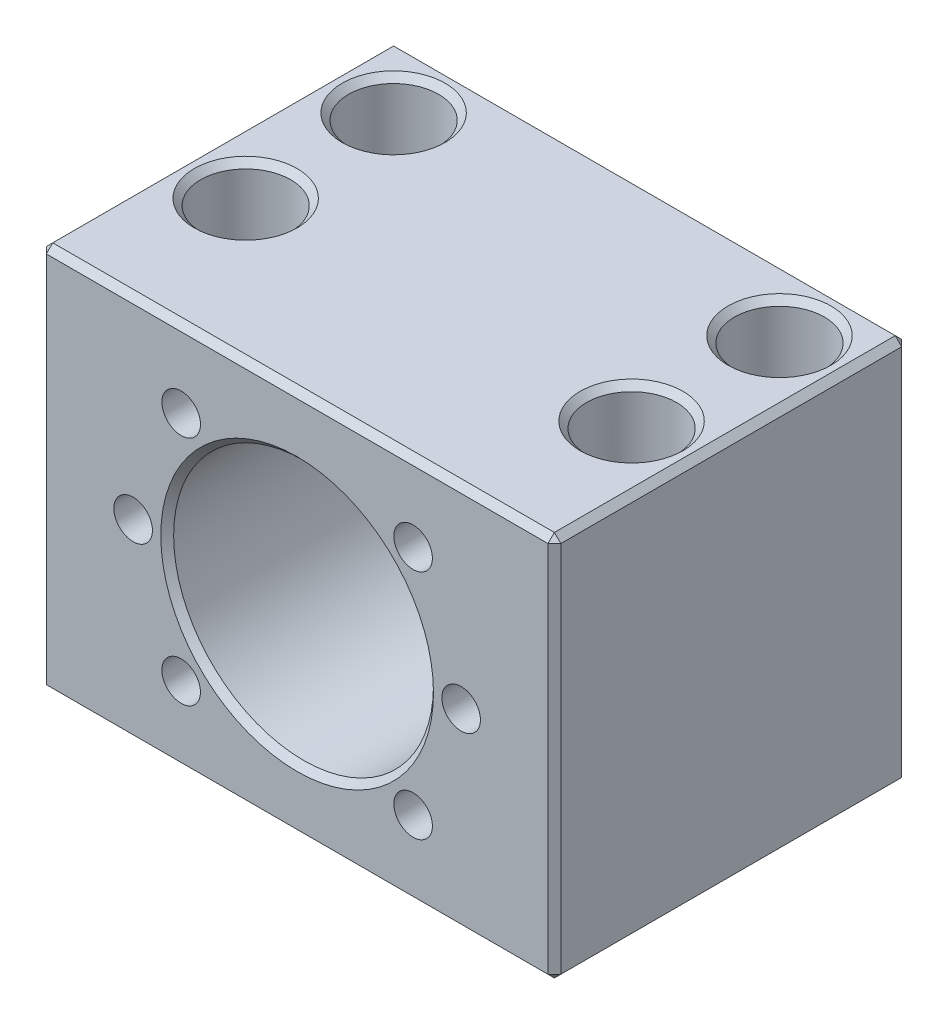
ISO-10303-21;
HEADER;
FILE_DESCRIPTION(('STEP AP214'),'2;1');
FILE_NAME('part.step','',(''),(''),'','','');
FILE_SCHEMA(('AUTOMOTIVE_DESIGN { 1 0 10303 214 1 1 1 1 }'));
ENDSEC;
DATA;
#1=APPLICATION_CONTEXT('core data for automotive mechanical design processes');
#2=APPLICATION_PROTOCOL_DEFINITION('international standard','automotive_design',2000,#1);
#3=PRODUCT_CONTEXT('',#1,'mechanical');
#4=PRODUCT('Part','Part','',(#3));
#5=PRODUCT_RELATED_PRODUCT_CATEGORY('part','',(#4));
#6=PRODUCT_DEFINITION_FORMATION('','',#4);
#7=PRODUCT_DEFINITION_CONTEXT('part definition',#1,'design');
#8=PRODUCT_DEFINITION('design','',#6,#7);
#9=PRODUCT_DEFINITION_SHAPE('','',#8);
#10=(LENGTH_UNIT() NAMED_UNIT(*) SI_UNIT(.MILLI.,.METRE.));
#11=(NAMED_UNIT(*) PLANE_ANGLE_UNIT() SI_UNIT($,.RADIAN.));
#12=(NAMED_UNIT(*) SI_UNIT($,.STERADIAN.) SOLID_ANGLE_UNIT());
#13=UNCERTAINTY_MEASURE_WITH_UNIT(LENGTH_MEASURE(1.E-05),#10,'distance_accuracy_value','');
#14=(GEOMETRIC_REPRESENTATION_CONTEXT(3) GLOBAL_UNCERTAINTY_ASSIGNED_CONTEXT((#13)) GLOBAL_UNIT_ASSIGNED_CONTEXT((#10,
#11,#12)) REPRESENTATION_CONTEXT('',''));
#15=CARTESIAN_POINT('',(0.,0.,0.));
#16=DIRECTION('',(0.,0.,1.));
#17=DIRECTION('',(1.,0.,0.));
#18=AXIS2_PLACEMENT_3D('',#15,#16,#17);
#19=CARTESIAN_POINT('',(30.,19.,-45.));
#20=DIRECTION('',(0.,1.,0.));
#21=DIRECTION('',(0.,0.,1.));
#22=AXIS2_PLACEMENT_3D('',#19,#20,#21);
#23=PLANE('',#22);
#24=CARTESIAN_POINT('',(30.,19.,-45.));
#25=DIRECTION('',(0.,-1.,0.));
#26=DIRECTION('',(0.,0.,-1.));
#27=AXIS2_PLACEMENT_3D('',#24,#25,#26);
#28=CIRCLE('',#27,4.2);
#29=CARTESIAN_POINT('',(30.,19.,-49.2));
#30=VERTEX_POINT('',#29);
#31=EDGE_CURVE('E356',#30,#30,#28,.T.);
#32=ORIENTED_EDGE('',*,*,#31,.T.);
#33=EDGE_LOOP('',(#32));
#34=FACE_BOUND('',#33,.T.);
#35=CARTESIAN_POINT('',(30.,19.,-45.));
#36=DIRECTION('',(0.,-1.,0.));
#37=DIRECTION('',(0.,0.,-1.));
#38=AXIS2_PLACEMENT_3D('',#35,#36,#37);
#39=CIRCLE('',#38,7.);
#40=CARTESIAN_POINT('',(30.,19.,-52.));
#41=VERTEX_POINT('',#40);
#42=EDGE_CURVE('E345',#41,#41,#39,.F.);
#43=ORIENTED_EDGE('',*,*,#42,.T.);
#44=EDGE_LOOP('',(#43));
#45=FACE_BOUND('',#44,.T.);
#46=ADVANCED_FACE('F15',(#34,#45),#23,.T.);
#47=CARTESIAN_POINT('',(-30.,19.,-45.));
#48=DIRECTION('',(0.,1.,0.));
#49=DIRECTION('',(0.,0.,1.));
#50=AXIS2_PLACEMENT_3D('',#47,#48,#49);
#51=PLANE('',#50);
#52=CARTESIAN_POINT('',(-30.,19.,-45.));
#53=DIRECTION('',(0.,-1.,0.));
#54=DIRECTION('',(0.,0.,-1.));
#55=AXIS2_PLACEMENT_3D('',#52,#53,#54);
#56=CIRCLE('',#55,4.2);
#57=CARTESIAN_POINT('',(-30.,19.,-49.2));
#58=VERTEX_POINT('',#57);
#59=EDGE_CURVE('E349',#58,#58,#56,.T.);
#60=ORIENTED_EDGE('',*,*,#59,.T.);
#61=EDGE_LOOP('',(#60));
#62=FACE_BOUND('',#61,.T.);
#63=CARTESIAN_POINT('',(-30.,19.,-45.));
#64=DIRECTION('',(0.,-1.,0.));
#65=DIRECTION('',(0.,0.,-1.));
#66=AXIS2_PLACEMENT_3D('',#63,#64,#65);
#67=CIRCLE('',#66,7.);
#68=CARTESIAN_POINT('',(-30.,19.,-52.));
#69=VERTEX_POINT('',#68);
#70=EDGE_CURVE('E341',#69,#69,#67,.F.);
#71=ORIENTED_EDGE('',*,*,#70,.T.);
#72=EDGE_LOOP('',(#71));
#73=FACE_BOUND('',#72,.T.);
#74=ADVANCED_FACE('F1276',(#62,#73),#51,.T.);
#75=CARTESIAN_POINT('',(-30.,19.,-22.));
#76=DIRECTION('',(0.,1.,0.));
#77=DIRECTION('',(0.,0.,1.));
#78=AXIS2_PLACEMENT_3D('',#75,#76,#77);
#79=PLANE('',#78);
#80=CARTESIAN_POINT('',(-30.,19.,-22.));
#81=DIRECTION('',(0.,-1.,0.));
#82=DIRECTION('',(0.,0.,-1.));
#83=AXIS2_PLACEMENT_3D('',#80,#81,#82);
#84=CIRCLE('',#83,4.2);
#85=CARTESIAN_POINT('',(-30.,19.,-26.2));
#86=VERTEX_POINT('',#85);
#87=EDGE_CURVE('E18',#86,#86,#84,.T.);
#88=ORIENTED_EDGE('',*,*,#87,.T.);
#89=EDGE_LOOP('',(#88));
#90=FACE_BOUND('',#89,.T.);
#91=CARTESIAN_POINT('',(-30.,19.,-22.));
#92=DIRECTION('',(0.,-1.,0.));
#93=DIRECTION('',(0.,0.,-1.));
#94=AXIS2_PLACEMENT_3D('',#91,#92,#93);
#95=CIRCLE('',#94,7.);
#96=CARTESIAN_POINT('',(-30.,19.,-29.));
#97=VERTEX_POINT('',#96);
#98=EDGE_CURVE('E337',#97,#97,#95,.F.);
#99=ORIENTED_EDGE('',*,*,#98,.T.);
#100=EDGE_LOOP('',(#99));
#101=FACE_BOUND('',#100,.T.);
#102=ADVANCED_FACE('F365',(#90,#101),#79,.T.);
#103=CARTESIAN_POINT('',(30.,19.,-22.));
#104=DIRECTION('',(0.,1.,0.));
#105=DIRECTION('',(0.,0.,1.));
#106=AXIS2_PLACEMENT_3D('',#103,#104,#105);
#107=PLANE('',#106);
#108=CARTESIAN_POINT('',(30.,19.,-22.));
#109=DIRECTION('',(0.,-1.,0.));
#110=DIRECTION('',(0.,0.,-1.));
#111=AXIS2_PLACEMENT_3D('',#108,#109,#110);
#112=CIRCLE('',#111,4.2);
#113=CARTESIAN_POINT('',(30.,19.,-26.2));
#114=VERTEX_POINT('',#113);
#115=EDGE_CURVE('E353',#114,#114,#112,.T.);
#116=ORIENTED_EDGE('',*,*,#115,.T.);
#117=EDGE_LOOP('',(#116));
#118=FACE_BOUND('',#117,.T.);
#119=CARTESIAN_POINT('',(30.,19.,-22.));
#120=DIRECTION('',(0.,-1.,0.));
#121=DIRECTION('',(0.,0.,-1.));
#122=AXIS2_PLACEMENT_3D('',#119,#120,#121);
#123=CIRCLE('',#122,7.);
#124=CARTESIAN_POINT('',(30.,19.,-29.));
#125=VERTEX_POINT('',#124);
#126=EDGE_CURVE('E333',#125,#125,#123,.F.);
#127=ORIENTED_EDGE('',*,*,#126,.T.);
#128=EDGE_LOOP('',(#127));
#129=FACE_BOUND('',#128,.T.);
#130=ADVANCED_FACE('F371',(#118,#129),#107,.T.);
#131=CARTESIAN_POINT('',(-30.,30.,-22.));
#132=DIRECTION('',(0.,-1.,0.));
#133=DIRECTION('',(0.,0.,-1.));
#134=AXIS2_PLACEMENT_3D('',#131,#132,#133);
#135=CYLINDRICAL_SURFACE('',#134,4.2);
#136=CARTESIAN_POINT('',(-30.,-15.,-22.));
#137=DIRECTION('',(0.,-1.,0.));
#138=DIRECTION('',(0.,0.,-1.));
#139=AXIS2_PLACEMENT_3D('',#136,#137,#138);
#140=CIRCLE('',#139,4.2);
#141=CARTESIAN_POINT('',(-30.,-15.,-26.2));
#142=VERTEX_POINT('',#141);
#143=EDGE_CURVE('E329',#142,#142,#140,.F.);
#144=ORIENTED_EDGE('',*,*,#143,.F.);
#145=EDGE_LOOP('',(#144));
#146=FACE_BOUND('',#145,.T.);
#147=ORIENTED_EDGE('',*,*,#87,.F.);
#148=EDGE_LOOP('',(#147));
#149=FACE_BOUND('',#148,.T.);
#150=ADVANCED_FACE('F368',(#146,#149),#135,.F.);
#151=CARTESIAN_POINT('',(30.,30.,-45.));
#152=DIRECTION('',(0.,-1.,0.));
#153=DIRECTION('',(0.,0.,-1.));
#154=AXIS2_PLACEMENT_3D('',#151,#152,#153);
#155=CYLINDRICAL_SURFACE('',#154,4.2);
#156=CARTESIAN_POINT('',(30.,-15.,-45.));
#157=DIRECTION('',(0.,-1.,0.));
#158=DIRECTION('',(0.,0.,-1.));
#159=AXIS2_PLACEMENT_3D('',#156,#157,#158);
#160=CIRCLE('',#159,4.2);
#161=CARTESIAN_POINT('',(30.,-15.,-49.2));
#162=VERTEX_POINT('',#161);
#163=EDGE_CURVE('E325',#162,#162,#160,.F.);
#164=ORIENTED_EDGE('',*,*,#163,.F.);
#165=EDGE_LOOP('',(#164));
#166=FACE_BOUND('',#165,.T.);
#167=ORIENTED_EDGE('',*,*,#31,.F.);
#168=EDGE_LOOP('',(#167));
#169=FACE_BOUND('',#168,.T.);
#170=ADVANCED_FACE('F370',(#166,#169),#155,.F.);
#171=CARTESIAN_POINT('',(30.,30.,-22.));
#172=DIRECTION('',(0.,-1.,0.));
#173=DIRECTION('',(0.,0.,-1.));
#174=AXIS2_PLACEMENT_3D('',#171,#172,#173);
#175=CYLINDRICAL_SURFACE('',#174,4.2);
#176=CARTESIAN_POINT('',(30.,-15.,-22.));
#177=DIRECTION('',(0.,-1.,0.));
#178=DIRECTION('',(0.,0.,-1.));
#179=AXIS2_PLACEMENT_3D('',#176,#177,#178);
#180=CIRCLE('',#179,4.2);
#181=CARTESIAN_POINT('',(30.,-15.,-26.2));
#182=VERTEX_POINT('',#181);
#183=EDGE_CURVE('E321',#182,#182,#180,.F.);
#184=ORIENTED_EDGE('',*,*,#183,.F.);
#185=EDGE_LOOP('',(#184));
#186=FACE_BOUND('',#185,.T.);
#187=ORIENTED_EDGE('',*,*,#115,.F.);
#188=EDGE_LOOP('',(#187));
#189=FACE_BOUND('',#188,.T.);
#190=ADVANCED_FACE('F379',(#186,#189),#175,.F.);
#191=CARTESIAN_POINT('',(-30.,30.,-45.));
#192=DIRECTION('',(0.,-1.,0.));
#193=DIRECTION('',(0.,0.,-1.));
#194=AXIS2_PLACEMENT_3D('',#191,#192,#193);
#195=CYLINDRICAL_SURFACE('',#194,4.2);
#196=CARTESIAN_POINT('',(-30.,-15.,-45.));
#197=DIRECTION('',(0.,-1.,0.));
#198=DIRECTION('',(0.,0.,-1.));
#199=AXIS2_PLACEMENT_3D('',#196,#197,#198);
#200=CIRCLE('',#199,4.2);
#201=CARTESIAN_POINT('',(-30.,-15.,-49.2));
#202=VERTEX_POINT('',#201);
#203=EDGE_CURVE('E214',#202,#202,#200,.F.);
#204=ORIENTED_EDGE('',*,*,#203,.F.);
#205=EDGE_LOOP('',(#204));
#206=FACE_BOUND('',#205,.T.);
#207=ORIENTED_EDGE('',*,*,#59,.F.);
#208=EDGE_LOOP('',(#207));
#209=FACE_BOUND('',#208,.T.);
#210=ADVANCED_FACE('F607',(#206,#209),#195,.F.);
#211=CARTESIAN_POINT('',(30.,30.,-45.));
#212=DIRECTION('',(0.,-1.,0.));
#213=DIRECTION('',(0.,0.,-1.));
#214=AXIS2_PLACEMENT_3D('',#211,#212,#213);
#215=CYLINDRICAL_SURFACE('',#214,7.);
#216=ORIENTED_EDGE('',*,*,#42,.F.);
#217=EDGE_LOOP('',(#216));
#218=FACE_BOUND('',#217,.T.);
#219=CARTESIAN_POINT('',(30.,29.,-45.));
#220=DIRECTION('',(0.,1.,0.));
#221=DIRECTION('',(-1.,0.,0.));
#222=AXIS2_PLACEMENT_3D('',#219,#220,#221);
#223=CIRCLE('',#222,7.);
#224=CARTESIAN_POINT('',(23.,29.,-45.));
#225=VERTEX_POINT('',#224);
#226=EDGE_CURVE('E210',#225,#225,#223,.T.);
#227=ORIENTED_EDGE('',*,*,#226,.T.);
#228=EDGE_LOOP('',(#227));
#229=FACE_BOUND('',#228,.T.);
#230=ADVANCED_FACE('F603',(#218,#229),#215,.F.);
#231=CARTESIAN_POINT('',(-30.,30.,-45.));
#232=DIRECTION('',(0.,-1.,0.));
#233=DIRECTION('',(0.,0.,-1.));
#234=AXIS2_PLACEMENT_3D('',#231,#232,#233);
#235=CYLINDRICAL_SURFACE('',#234,7.);
#236=ORIENTED_EDGE('',*,*,#70,.F.);
#237=EDGE_LOOP('',(#236));
#238=FACE_BOUND('',#237,.T.);
#239=CARTESIAN_POINT('',(-30.,29.,-45.));
#240=DIRECTION('',(0.,1.,0.));
#241=DIRECTION('',(-1.,0.,0.));
#242=AXIS2_PLACEMENT_3D('',#239,#240,#241);
#243=CIRCLE('',#242,7.);
#244=CARTESIAN_POINT('',(-37.,29.,-45.));
#245=VERTEX_POINT('',#244);
#246=EDGE_CURVE('E206',#245,#245,#243,.T.);
#247=ORIENTED_EDGE('',*,*,#246,.T.);
#248=EDGE_LOOP('',(#247));
#249=FACE_BOUND('',#248,.T.);
#250=ADVANCED_FACE('F599',(#238,#249),#235,.F.);
#251=CARTESIAN_POINT('',(-30.,30.,-22.));
#252=DIRECTION('',(0.,-1.,0.));
#253=DIRECTION('',(0.,0.,-1.));
#254=AXIS2_PLACEMENT_3D('',#251,#252,#253);
#255=CYLINDRICAL_SURFACE('',#254,7.);
#256=ORIENTED_EDGE('',*,*,#98,.F.);
#257=EDGE_LOOP('',(#256));
#258=FACE_BOUND('',#257,.T.);
#259=CARTESIAN_POINT('',(-30.,29.,-22.));
#260=DIRECTION('',(0.,1.,0.));
#261=DIRECTION('',(-1.,0.,0.));
#262=AXIS2_PLACEMENT_3D('',#259,#260,#261);
#263=CIRCLE('',#262,7.);
#264=CARTESIAN_POINT('',(-37.,29.,-22.));
#265=VERTEX_POINT('',#264);
#266=EDGE_CURVE('E202',#265,#265,#263,.T.);
#267=ORIENTED_EDGE('',*,*,#266,.T.);
#268=EDGE_LOOP('',(#267));
#269=FACE_BOUND('',#268,.T.);
#270=ADVANCED_FACE('F595',(#258,#269),#255,.F.);
#271=CARTESIAN_POINT('',(30.,30.,-22.));
#272=DIRECTION('',(0.,-1.,0.));
#273=DIRECTION('',(0.,0.,-1.));
#274=AXIS2_PLACEMENT_3D('',#271,#272,#273);
#275=CYLINDRICAL_SURFACE('',#274,7.);
#276=ORIENTED_EDGE('',*,*,#126,.F.);
#277=EDGE_LOOP('',(#276));
#278=FACE_BOUND('',#277,.T.);
#279=CARTESIAN_POINT('',(30.,29.,-22.));
#280=DIRECTION('',(0.,1.,0.));
#281=DIRECTION('',(-1.,0.,0.));
#282=AXIS2_PLACEMENT_3D('',#279,#280,#281);
#283=CIRCLE('',#282,7.);
#284=CARTESIAN_POINT('',(23.,29.,-22.));
#285=VERTEX_POINT('',#284);
#286=EDGE_CURVE('E197',#285,#285,#283,.T.);
#287=ORIENTED_EDGE('',*,*,#286,.T.);
#288=EDGE_LOOP('',(#287));
#289=FACE_BOUND('',#288,.T.);
#290=ADVANCED_FACE('F591',(#278,#289),#275,.F.);
#291=CARTESIAN_POINT('',(-30.,-15.,-22.));
#292=DIRECTION('',(0.,-1.,0.));
#293=DIRECTION('',(0.,0.,-1.));
#294=AXIS2_PLACEMENT_3D('',#291,#292,#293);
#295=PLANE('',#294);
#296=ORIENTED_EDGE('',*,*,#143,.T.);
#297=EDGE_LOOP('',(#296));
#298=FACE_BOUND('',#297,.T.);
#299=CARTESIAN_POINT('',(-30.,-15.,-22.));
#300=DIRECTION('',(0.,1.,0.));
#301=DIRECTION('',(0.,0.,1.));
#302=AXIS2_PLACEMENT_3D('',#299,#300,#301);
#303=CIRCLE('',#302,5.);
#304=CARTESIAN_POINT('',(-30.,-15.,-17.));
#305=VERTEX_POINT('',#304);
#306=EDGE_CURVE('E201',#305,#305,#303,.F.);
#307=ORIENTED_EDGE('',*,*,#306,.T.);
#308=EDGE_LOOP('',(#307));
#309=FACE_BOUND('',#308,.T.);
#310=ADVANCED_FACE('F587',(#298,#309),#295,.T.);
#311=CARTESIAN_POINT('',(30.,-15.,-45.));
#312=DIRECTION('',(0.,-1.,0.));
#313=DIRECTION('',(0.,0.,-1.));
#314=AXIS2_PLACEMENT_3D('',#311,#312,#313);
#315=PLANE('',#314);
#316=ORIENTED_EDGE('',*,*,#163,.T.);
#317=EDGE_LOOP('',(#316));
#318=FACE_BOUND('',#317,.T.);
#319=CARTESIAN_POINT('',(30.,-15.,-45.));
#320=DIRECTION('',(0.,1.,0.));
#321=DIRECTION('',(0.,0.,1.));
#322=AXIS2_PLACEMENT_3D('',#319,#320,#321);
#323=CIRCLE('',#322,5.);
#324=CARTESIAN_POINT('',(30.,-15.,-40.));
#325=VERTEX_POINT('',#324);
#326=EDGE_CURVE('E311',#325,#325,#323,.F.);
#327=ORIENTED_EDGE('',*,*,#326,.T.);
#328=EDGE_LOOP('',(#327));
#329=FACE_BOUND('',#328,.T.);
#330=ADVANCED_FACE('F583',(#318,#329),#315,.T.);
#331=CARTESIAN_POINT('',(30.,-15.,-22.));
#332=DIRECTION('',(0.,-1.,0.));
#333=DIRECTION('',(0.,0.,-1.));
#334=AXIS2_PLACEMENT_3D('',#331,#332,#333);
#335=PLANE('',#334);
#336=ORIENTED_EDGE('',*,*,#183,.T.);
#337=EDGE_LOOP('',(#336));
#338=FACE_BOUND('',#337,.T.);
#339=CARTESIAN_POINT('',(30.,-15.,-22.));
#340=DIRECTION('',(0.,1.,0.));
#341=DIRECTION('',(0.,0.,1.));
#342=AXIS2_PLACEMENT_3D('',#339,#340,#341);
#343=CIRCLE('',#342,5.);
#344=CARTESIAN_POINT('',(30.,-15.,-17.));
#345=VERTEX_POINT('',#344);
#346=EDGE_CURVE('E307',#345,#345,#343,.F.);
#347=ORIENTED_EDGE('',*,*,#346,.T.);
#348=EDGE_LOOP('',(#347));
#349=FACE_BOUND('',#348,.T.);
#350=ADVANCED_FACE('F579',(#338,#349),#335,.T.);
#351=CARTESIAN_POINT('',(-30.,-15.,-45.));
#352=DIRECTION('',(0.,-1.,0.));
#353=DIRECTION('',(0.,0.,-1.));
#354=AXIS2_PLACEMENT_3D('',#351,#352,#353);
#355=PLANE('',#354);
#356=ORIENTED_EDGE('',*,*,#203,.T.);
#357=EDGE_LOOP('',(#356));
#358=FACE_BOUND('',#357,.T.);
#359=CARTESIAN_POINT('',(-30.,-15.,-45.));
#360=DIRECTION('',(0.,1.,0.));
#361=DIRECTION('',(0.,0.,1.));
#362=AXIS2_PLACEMENT_3D('',#359,#360,#361);
#363=CIRCLE('',#362,5.);
#364=CARTESIAN_POINT('',(-30.,-15.,-40.));
#365=VERTEX_POINT('',#364);
#366=EDGE_CURVE('E135',#365,#365,#363,.F.);
#367=ORIENTED_EDGE('',*,*,#366,.T.);
#368=EDGE_LOOP('',(#367));
#369=FACE_BOUND('',#368,.T.);
#370=ADVANCED_FACE('F575',(#358,#369),#355,.T.);
#371=CARTESIAN_POINT('',(30.,30.,-45.));
#372=DIRECTION('',(0.,1.,0.));
#373=DIRECTION('',(0.,0.,1.));
#374=AXIS2_PLACEMENT_3D('',#371,#372,#373);
#375=CONICAL_SURFACE('',#374,8.,0.785398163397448);
#376=CARTESIAN_POINT('',(30.,30.,-45.));
#377=DIRECTION('',(0.,1.,0.));
#378=DIRECTION('',(0.,0.,1.));
#379=AXIS2_PLACEMENT_3D('',#376,#377,#378);
#380=CIRCLE('',#379,8.);
#381=CARTESIAN_POINT('',(30.,30.,-37.));
#382=VERTEX_POINT('',#381);
#383=EDGE_CURVE('E186',#382,#382,#380,.F.);
#384=ORIENTED_EDGE('',*,*,#383,.F.);
#385=EDGE_LOOP('',(#384));
#386=FACE_BOUND('',#385,.T.);
#387=ORIENTED_EDGE('',*,*,#226,.F.);
#388=EDGE_LOOP('',(#387));
#389=FACE_BOUND('',#388,.T.);
#390=ADVANCED_FACE('F571',(#386,#389),#375,.F.);
#391=CARTESIAN_POINT('',(-30.,30.,-45.));
#392=DIRECTION('',(0.,1.,0.));
#393=DIRECTION('',(0.,0.,1.));
#394=AXIS2_PLACEMENT_3D('',#391,#392,#393);
#395=CONICAL_SURFACE('',#394,8.,0.785398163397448);
#396=CARTESIAN_POINT('',(-30.,30.,-45.));
#397=DIRECTION('',(0.,1.,0.));
#398=DIRECTION('',(0.,0.,1.));
#399=AXIS2_PLACEMENT_3D('',#396,#397,#398);
#400=CIRCLE('',#399,8.);
#401=CARTESIAN_POINT('',(-30.,30.,-37.));
#402=VERTEX_POINT('',#401);
#403=EDGE_CURVE('E297',#402,#402,#400,.F.);
#404=ORIENTED_EDGE('',*,*,#403,.F.);
#405=EDGE_LOOP('',(#404));
#406=FACE_BOUND('',#405,.T.);
#407=ORIENTED_EDGE('',*,*,#246,.F.);
#408=EDGE_LOOP('',(#407));
#409=FACE_BOUND('',#408,.T.);
#410=ADVANCED_FACE('F567',(#406,#409),#395,.F.);
#411=CARTESIAN_POINT('',(-30.,30.,-22.));
#412=DIRECTION('',(0.,1.,0.));
#413=DIRECTION('',(0.,0.,1.));
#414=AXIS2_PLACEMENT_3D('',#411,#412,#413);
#415=CONICAL_SURFACE('',#414,8.,0.785398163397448);
#416=CARTESIAN_POINT('',(-30.,30.,-22.));
#417=DIRECTION('',(0.,1.,0.));
#418=DIRECTION('',(0.,0.,1.));
#419=AXIS2_PLACEMENT_3D('',#416,#417,#418);
#420=CIRCLE('',#419,8.);
#421=CARTESIAN_POINT('',(-30.,30.,-14.));
#422=VERTEX_POINT('',#421);
#423=EDGE_CURVE('E293',#422,#422,#420,.F.);
#424=ORIENTED_EDGE('',*,*,#423,.F.);
#425=EDGE_LOOP('',(#424));
#426=FACE_BOUND('',#425,.T.);
#427=ORIENTED_EDGE('',*,*,#266,.F.);
#428=EDGE_LOOP('',(#427));
#429=FACE_BOUND('',#428,.T.);
#430=ADVANCED_FACE('F563',(#426,#429),#415,.F.);
#431=CARTESIAN_POINT('',(30.,30.,-22.));
#432=DIRECTION('',(0.,1.,0.));
#433=DIRECTION('',(0.,0.,1.));
#434=AXIS2_PLACEMENT_3D('',#431,#432,#433);
#435=CONICAL_SURFACE('',#434,8.,0.785398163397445);
#436=CARTESIAN_POINT('',(30.,30.,-22.));
#437=DIRECTION('',(0.,1.,0.));
#438=DIRECTION('',(0.,0.,1.));
#439=AXIS2_PLACEMENT_3D('',#436,#437,#438);
#440=CIRCLE('',#439,8.);
#441=CARTESIAN_POINT('',(30.,30.,-14.));
#442=VERTEX_POINT('',#441);
#443=EDGE_CURVE('E182',#442,#442,#440,.F.);
#444=ORIENTED_EDGE('',*,*,#443,.F.);
#445=EDGE_LOOP('',(#444));
#446=FACE_BOUND('',#445,.T.);
#447=ORIENTED_EDGE('',*,*,#286,.F.);
#448=EDGE_LOOP('',(#447));
#449=FACE_BOUND('',#448,.T.);
#450=ADVANCED_FACE('F559',(#446,#449),#435,.F.);
#451=CARTESIAN_POINT('',(39.5,29.5,0.));
#452=DIRECTION('',(0.707106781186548,0.707106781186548,0.));
#453=DIRECTION('',(-0.707106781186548,0.707106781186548,0.));
#454=AXIS2_PLACEMENT_3D('',#451,#452,#453);
#455=PLANE('',#454);
#456=DIRECTION('',(-0.707106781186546,0.707106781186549,0.));
#457=VECTOR('',#456,1.);
#458=CARTESIAN_POINT('',(40.,29.,-1.));
#459=LINE('',#458,#457);
#460=CARTESIAN_POINT('',(40.,29.,-1.));
#461=VERTEX_POINT('',#460);
#462=CARTESIAN_POINT('',(39.,30.,-1.));
#463=VERTEX_POINT('',#462);
#464=EDGE_CURVE('E190',#461,#463,#459,.T.);
#465=ORIENTED_EDGE('',*,*,#464,.F.);
#466=DIRECTION('',(0.,0.,-1.));
#467=VECTOR('',#466,1.);
#468=CARTESIAN_POINT('',(40.,29.,0.));
#469=LINE('',#468,#467);
#470=CARTESIAN_POINT('',(40.,29.,-54.));
#471=VERTEX_POINT('',#470);
#472=EDGE_CURVE('E173',#471,#461,#469,.F.);
#473=ORIENTED_EDGE('',*,*,#472,.F.);
#474=DIRECTION('',(0.707106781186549,-0.707106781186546,0.));
#475=VECTOR('',#474,1.);
#476=CARTESIAN_POINT('',(39.,30.,-54.));
#477=LINE('',#476,#475);
#478=CARTESIAN_POINT('',(39.,30.,-54.));
#479=VERTEX_POINT('',#478);
#480=EDGE_CURVE('E179',#479,#471,#477,.T.);
#481=ORIENTED_EDGE('',*,*,#480,.F.);
#482=DIRECTION('',(0.,0.,1.));
#483=VECTOR('',#482,1.);
#484=CARTESIAN_POINT('',(39.,30.,0.));
#485=LINE('',#484,#483);
#486=EDGE_CURVE('E187',#463,#479,#485,.F.);
#487=ORIENTED_EDGE('',*,*,#486,.F.);
#488=EDGE_LOOP('',(#465,#473,#481,#487));
#489=FACE_BOUND('',#488,.T.);
#490=ADVANCED_FACE('F555',(#489),#455,.T.);
#491=CARTESIAN_POINT('',(39.5,-29.5,0.));
#492=DIRECTION('',(0.707106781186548,-0.707106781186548,0.));
#493=DIRECTION('',(0.707106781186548,0.707106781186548,0.));
#494=AXIS2_PLACEMENT_3D('',#491,#492,#493);
#495=PLANE('',#494);
#496=DIRECTION('',(0.707106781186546,0.707106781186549,0.));
#497=VECTOR('',#496,1.);
#498=CARTESIAN_POINT('',(39.,-30.,-1.));
#499=LINE('',#498,#497);
#500=CARTESIAN_POINT('',(39.,-30.,-1.));
#501=VERTEX_POINT('',#500);
#502=CARTESIAN_POINT('',(40.,-29.,-1.));
#503=VERTEX_POINT('',#502);
#504=EDGE_CURVE('E134',#501,#503,#499,.T.);
#505=ORIENTED_EDGE('',*,*,#504,.F.);
#506=DIRECTION('',(0.,0.,-1.));
#507=VECTOR('',#506,1.);
#508=CARTESIAN_POINT('',(39.,-30.,0.));
#509=LINE('',#508,#507);
#510=CARTESIAN_POINT('',(39.,-30.,-54.));
#511=VERTEX_POINT('',#510);
#512=EDGE_CURVE('E164',#511,#501,#509,.F.);
#513=ORIENTED_EDGE('',*,*,#512,.F.);
#514=DIRECTION('',(-0.707106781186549,-0.707106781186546,0.));
#515=VECTOR('',#514,1.);
#516=CARTESIAN_POINT('',(40.,-29.,-54.));
#517=LINE('',#516,#515);
#518=CARTESIAN_POINT('',(40.,-29.,-54.));
#519=VERTEX_POINT('',#518);
#520=EDGE_CURVE('E170',#519,#511,#517,.T.);
#521=ORIENTED_EDGE('',*,*,#520,.F.);
#522=DIRECTION('',(0.,0.,-1.));
#523=VECTOR('',#522,1.);
#524=CARTESIAN_POINT('',(40.,-29.,0.));
#525=LINE('',#524,#523);
#526=EDGE_CURVE('E176',#503,#519,#525,.T.);
#527=ORIENTED_EDGE('',*,*,#526,.F.);
#528=EDGE_LOOP('',(#505,#513,#521,#527));
#529=FACE_BOUND('',#528,.T.);
#530=ADVANCED_FACE('F551',(#529),#495,.T.);
#531=CARTESIAN_POINT('',(-30.,-30.,-22.));
#532=DIRECTION('',(0.,1.,0.));
#533=DIRECTION('',(0.,0.,1.));
#534=AXIS2_PLACEMENT_3D('',#531,#532,#533);
#535=CYLINDRICAL_SURFACE('',#534,5.);
#536=ORIENTED_EDGE('',*,*,#306,.F.);
#537=EDGE_LOOP('',(#536));
#538=FACE_BOUND('',#537,.T.);
#539=CARTESIAN_POINT('',(-30.,-30.,-22.));
#540=DIRECTION('',(0.,1.,0.));
#541=DIRECTION('',(0.,0.,1.));
#542=AXIS2_PLACEMENT_3D('',#539,#540,#541);
#543=CIRCLE('',#542,5.);
#544=CARTESIAN_POINT('',(-30.,-30.,-17.));
#545=VERTEX_POINT('',#544);
#546=EDGE_CURVE('E167',#545,#545,#543,.T.);
#547=ORIENTED_EDGE('',*,*,#546,.F.);
#548=EDGE_LOOP('',(#547));
#549=FACE_BOUND('',#548,.T.);
#550=ADVANCED_FACE('F547',(#538,#549),#535,.F.);
#551=CARTESIAN_POINT('',(30.,-30.,-45.));
#552=DIRECTION('',(0.,1.,0.));
#553=DIRECTION('',(0.,0.,1.));
#554=AXIS2_PLACEMENT_3D('',#551,#552,#553);
#555=CYLINDRICAL_SURFACE('',#554,5.);
#556=ORIENTED_EDGE('',*,*,#326,.F.);
#557=EDGE_LOOP('',(#556));
#558=FACE_BOUND('',#557,.T.);
#559=CARTESIAN_POINT('',(30.,-30.,-45.));
#560=DIRECTION('',(0.,1.,0.));
#561=DIRECTION('',(0.,0.,1.));
#562=AXIS2_PLACEMENT_3D('',#559,#560,#561);
#563=CIRCLE('',#562,5.);
#564=CARTESIAN_POINT('',(30.,-30.,-40.));
#565=VERTEX_POINT('',#564);
#566=EDGE_CURVE('E283',#565,#565,#563,.T.);
#567=ORIENTED_EDGE('',*,*,#566,.F.);
#568=EDGE_LOOP('',(#567));
#569=FACE_BOUND('',#568,.T.);
#570=ADVANCED_FACE('F543',(#558,#569),#555,.F.);
#571=CARTESIAN_POINT('',(30.,-30.,-22.));
#572=DIRECTION('',(0.,1.,0.));
#573=DIRECTION('',(0.,0.,1.));
#574=AXIS2_PLACEMENT_3D('',#571,#572,#573);
#575=CYLINDRICAL_SURFACE('',#574,5.);
#576=ORIENTED_EDGE('',*,*,#346,.F.);
#577=EDGE_LOOP('',(#576));
#578=FACE_BOUND('',#577,.T.);
#579=CARTESIAN_POINT('',(30.,-30.,-22.));
#580=DIRECTION('',(0.,1.,0.));
#581=DIRECTION('',(0.,0.,1.));
#582=AXIS2_PLACEMENT_3D('',#579,#580,#581);
#583=CIRCLE('',#582,5.);
#584=CARTESIAN_POINT('',(30.,-30.,-17.));
#585=VERTEX_POINT('',#584);
#586=EDGE_CURVE('E279',#585,#585,#583,.T.);
#587=ORIENTED_EDGE('',*,*,#586,.F.);
#588=EDGE_LOOP('',(#587));
#589=FACE_BOUND('',#588,.T.);
#590=ADVANCED_FACE('F539',(#578,#589),#575,.F.);
#591=CARTESIAN_POINT('',(-30.,-30.,-45.));
#592=DIRECTION('',(0.,1.,0.));
#593=DIRECTION('',(0.,0.,1.));
#594=AXIS2_PLACEMENT_3D('',#591,#592,#593);
#595=CYLINDRICAL_SURFACE('',#594,5.);
#596=ORIENTED_EDGE('',*,*,#366,.F.);
#597=EDGE_LOOP('',(#596));
#598=FACE_BOUND('',#597,.T.);
#599=CARTESIAN_POINT('',(-30.,-30.,-45.));
#600=DIRECTION('',(0.,1.,0.));
#601=DIRECTION('',(0.,0.,1.));
#602=AXIS2_PLACEMENT_3D('',#599,#600,#601);
#603=CIRCLE('',#602,5.);
#604=CARTESIAN_POINT('',(-30.,-30.,-40.));
#605=VERTEX_POINT('',#604);
#606=EDGE_CURVE('E163',#605,#605,#603,.T.);
#607=ORIENTED_EDGE('',*,*,#606,.F.);
#608=EDGE_LOOP('',(#607));
#609=FACE_BOUND('',#608,.T.);
#610=ADVANCED_FACE('F535',(#598,#609),#595,.F.);
#611=CARTESIAN_POINT('',(-39.5,29.5,0.));
#612=DIRECTION('',(-0.707106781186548,0.707106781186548,0.));
#613=DIRECTION('',(-0.707106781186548,-0.707106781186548,0.));
#614=AXIS2_PLACEMENT_3D('',#611,#612,#613);
#615=PLANE('',#614);
#616=DIRECTION('',(-0.707106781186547,-0.707106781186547,0.));
#617=VECTOR('',#616,1.);
#618=CARTESIAN_POINT('',(-39.,30.,-0.999999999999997));
#619=LINE('',#618,#617);
#620=CARTESIAN_POINT('',(-39.,30.,-1.));
#621=VERTEX_POINT('',#620);
#622=CARTESIAN_POINT('',(-40.,29.,-1.));
#623=VERTEX_POINT('',#622);
#624=EDGE_CURVE('E104',#621,#623,#619,.T.);
#625=ORIENTED_EDGE('',*,*,#624,.F.);
#626=DIRECTION('',(0.,0.,1.));
#627=VECTOR('',#626,1.);
#628=CARTESIAN_POINT('',(-39.,30.,0.));
#629=LINE('',#628,#627);
#630=CARTESIAN_POINT('',(-39.,30.,-54.));
#631=VERTEX_POINT('',#630);
#632=EDGE_CURVE('E183',#631,#621,#629,.T.);
#633=ORIENTED_EDGE('',*,*,#632,.F.);
#634=DIRECTION('',(0.707106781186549,0.707106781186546,0.));
#635=VECTOR('',#634,1.);
#636=CARTESIAN_POINT('',(-40.,29.,-54.));
#637=LINE('',#636,#635);
#638=CARTESIAN_POINT('',(-40.,29.,-54.));
#639=VERTEX_POINT('',#638);
#640=EDGE_CURVE('E160',#639,#631,#637,.T.);
#641=ORIENTED_EDGE('',*,*,#640,.F.);
#642=DIRECTION('',(0.,0.,1.));
#643=VECTOR('',#642,1.);
#644=CARTESIAN_POINT('',(-40.,29.,0.));
#645=LINE('',#644,#643);
#646=EDGE_CURVE('E122',#623,#639,#645,.F.);
#647=ORIENTED_EDGE('',*,*,#646,.F.);
#648=EDGE_LOOP('',(#625,#633,#641,#647));
#649=FACE_BOUND('',#648,.T.);
#650=ADVANCED_FACE('F532',(#649),#615,.T.);
#651=CARTESIAN_POINT('',(-39.5,-29.5,0.));
#652=DIRECTION('',(-0.707106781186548,-0.707106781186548,0.));
#653=DIRECTION('',(0.707106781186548,-0.707106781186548,0.));
#654=AXIS2_PLACEMENT_3D('',#651,#652,#653);
#655=PLANE('',#654);
#656=DIRECTION('',(0.707106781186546,-0.707106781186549,0.));
#657=VECTOR('',#656,1.);
#658=CARTESIAN_POINT('',(-40.,-29.,-1.));
#659=LINE('',#658,#657);
#660=CARTESIAN_POINT('',(-40.,-29.,-1.));
#661=VERTEX_POINT('',#660);
#662=CARTESIAN_POINT('',(-39.,-30.,-1.));
#663=VERTEX_POINT('',#662);
#664=EDGE_CURVE('E125',#661,#663,#659,.T.);
#665=ORIENTED_EDGE('',*,*,#664,.F.);
#666=DIRECTION('',(0.,0.,1.));
#667=VECTOR('',#666,1.);
#668=CARTESIAN_POINT('',(-40.,-29.,0.));
#669=LINE('',#668,#667);
#670=CARTESIAN_POINT('',(-40.,-29.,-54.));
#671=VERTEX_POINT('',#670);
#672=EDGE_CURVE('E111',#671,#661,#669,.T.);
#673=ORIENTED_EDGE('',*,*,#672,.F.);
#674=DIRECTION('',(-0.707106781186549,0.707106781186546,0.));
#675=VECTOR('',#674,1.);
#676=CARTESIAN_POINT('',(-39.,-30.,-54.));
#677=LINE('',#676,#675);
#678=CARTESIAN_POINT('',(-39.,-30.,-54.));
#679=VERTEX_POINT('',#678);
#680=EDGE_CURVE('E157',#679,#671,#677,.T.);
#681=ORIENTED_EDGE('',*,*,#680,.F.);
#682=DIRECTION('',(0.,0.,-1.));
#683=VECTOR('',#682,1.);
#684=CARTESIAN_POINT('',(-39.,-30.,0.));
#685=LINE('',#684,#683);
#686=EDGE_CURVE('E127',#663,#679,#685,.T.);
#687=ORIENTED_EDGE('',*,*,#686,.F.);
#688=EDGE_LOOP('',(#665,#673,#681,#687));
#689=FACE_BOUND('',#688,.T.);
#690=ADVANCED_FACE('F126',(#689),#655,.T.);
#691=CARTESIAN_POINT('',(-40.,-29.,-1.));
#692=DIRECTION('',(-0.577350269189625,-0.577350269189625,0.577350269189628));
#693=DIRECTION('',(0.707106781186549,0.,0.707106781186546));
#694=AXIS2_PLACEMENT_3D('',#691,#692,#693);
#695=PLANE('',#694);
#696=DIRECTION('',(0.707106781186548,0.,0.707106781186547));
#697=VECTOR('',#696,1.);
#698=CARTESIAN_POINT('',(-39.5,-29.,-0.5));
#699=LINE('',#698,#697);
#700=CARTESIAN_POINT('',(-39.,-29.,0.));
#701=VERTEX_POINT('',#700);
#702=EDGE_CURVE('E121',#661,#701,#699,.T.);
#703=ORIENTED_EDGE('',*,*,#702,.F.);
#704=ORIENTED_EDGE('',*,*,#664,.T.);
#705=DIRECTION('',(0.,-0.707106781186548,-0.707106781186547));
#706=VECTOR('',#705,1.);
#707=CARTESIAN_POINT('',(-39.,-29.5,-0.5));
#708=LINE('',#707,#706);
#709=EDGE_CURVE('E147',#701,#663,#708,.T.);
#710=ORIENTED_EDGE('',*,*,#709,.F.);
#711=EDGE_LOOP('',(#703,#704,#710));
#712=FACE_BOUND('',#711,.T.);
#713=ADVANCED_FACE('F146',(#712),#695,.T.);
#714=CARTESIAN_POINT('',(39.,-30.,-1.));
#715=DIRECTION('',(0.577350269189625,-0.577350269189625,0.577350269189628));
#716=DIRECTION('',(0.707106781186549,0.,-0.707106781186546));
#717=AXIS2_PLACEMENT_3D('',#714,#715,#716);
#718=PLANE('',#717);
#719=DIRECTION('',(0.,-0.707106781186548,-0.707106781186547));
#720=VECTOR('',#719,1.);
#721=CARTESIAN_POINT('',(39.,-29.5,-0.5));
#722=LINE('',#721,#720);
#723=CARTESIAN_POINT('',(39.,-29.,0.));
#724=VERTEX_POINT('',#723);
#725=EDGE_CURVE('E144',#501,#724,#722,.F.);
#726=ORIENTED_EDGE('',*,*,#725,.F.);
#727=ORIENTED_EDGE('',*,*,#504,.T.);
#728=DIRECTION('',(0.707106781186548,0.,-0.707106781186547));
#729=VECTOR('',#728,1.);
#730=CARTESIAN_POINT('',(39.5,-29.,-0.5));
#731=LINE('',#730,#729);
#732=EDGE_CURVE('E650',#724,#503,#731,.T.);
#733=ORIENTED_EDGE('',*,*,#732,.F.);
#734=EDGE_LOOP('',(#726,#727,#733));
#735=FACE_BOUND('',#734,.T.);
#736=ADVANCED_FACE('F524',(#735),#718,.T.);
#737=CARTESIAN_POINT('',(-39.,29.,0.));
#738=DIRECTION('',(-0.577350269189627,0.577350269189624,0.577350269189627));
#739=DIRECTION('',(0.707106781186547,0.,0.707106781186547));
#740=AXIS2_PLACEMENT_3D('',#737,#738,#739);
#741=PLANE('',#740);
#742=DIRECTION('',(0.707106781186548,0.,0.707106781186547));
#743=VECTOR('',#742,1.);
#744=CARTESIAN_POINT('',(-39.5,29.,-0.5));
#745=LINE('',#744,#743);
#746=CARTESIAN_POINT('',(-39.,29.,0.));
#747=VERTEX_POINT('',#746);
#748=EDGE_CURVE('E141',#747,#623,#745,.F.);
#749=ORIENTED_EDGE('',*,*,#748,.F.);
#750=DIRECTION('',(0.,-0.707106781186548,0.707106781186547));
#751=VECTOR('',#750,1.);
#752=CARTESIAN_POINT('',(-39.,29.5,-0.5));
#753=LINE('',#752,#751);
#754=EDGE_CURVE('E665',#621,#747,#753,.T.);
#755=ORIENTED_EDGE('',*,*,#754,.F.);
#756=ORIENTED_EDGE('',*,*,#624,.T.);
#757=EDGE_LOOP('',(#749,#755,#756));
#758=FACE_BOUND('',#757,.T.);
#759=ADVANCED_FACE('F520',(#758),#741,.T.);
#760=CARTESIAN_POINT('',(40.,29.,-1.));
#761=DIRECTION('',(0.577350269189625,0.577350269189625,0.577350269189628));
#762=DIRECTION('',(0.707106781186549,0.,-0.707106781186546));
#763=AXIS2_PLACEMENT_3D('',#760,#761,#762);
#764=PLANE('',#763);
#765=DIRECTION('',(0.707106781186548,0.,-0.707106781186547));
#766=VECTOR('',#765,1.);
#767=CARTESIAN_POINT('',(39.5,29.,-0.5));
#768=LINE('',#767,#766);
#769=CARTESIAN_POINT('',(39.,29.,0.));
#770=VERTEX_POINT('',#769);
#771=EDGE_CURVE('E648',#461,#770,#768,.F.);
#772=ORIENTED_EDGE('',*,*,#771,.F.);
#773=ORIENTED_EDGE('',*,*,#464,.T.);
#774=DIRECTION('',(0.,-0.707106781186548,0.707106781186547));
#775=VECTOR('',#774,1.);
#776=CARTESIAN_POINT('',(39.,29.5,-0.5));
#777=LINE('',#776,#775);
#778=EDGE_CURVE('E668',#770,#463,#777,.F.);
#779=ORIENTED_EDGE('',*,*,#778,.F.);
#780=EDGE_LOOP('',(#772,#773,#779));
#781=FACE_BOUND('',#780,.T.);
#782=ADVANCED_FACE('F516',(#781),#764,.T.);
#783=CARTESIAN_POINT('',(-25.5,0.,-11.));
#784=DIRECTION('',(0.,0.,1.));
#785=DIRECTION('',(1.,0.,0.));
#786=AXIS2_PLACEMENT_3D('',#783,#784,#785);
#787=PLANE('',#786);
#788=CARTESIAN_POINT('',(-25.5,0.,-11.));
#789=DIRECTION('',(0.,0.,-1.));
#790=DIRECTION('',(-1.,0.,0.));
#791=AXIS2_PLACEMENT_3D('',#788,#789,#790);
#792=CIRCLE('',#791,3.);
#793=CARTESIAN_POINT('',(-28.5,0.,-11.));
#794=VERTEX_POINT('',#793);
#795=EDGE_CURVE('E271',#794,#794,#792,.F.);
#796=ORIENTED_EDGE('',*,*,#795,.T.);
#797=EDGE_LOOP('',(#796));
#798=FACE_BOUND('',#797,.T.);
#799=ADVANCED_FACE('F512',(#798),#787,.T.);
#800=CARTESIAN_POINT('',(18.031222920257,-18.031222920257,-11.));
#801=DIRECTION('',(0.,0.,1.));
#802=DIRECTION('',(1.,0.,0.));
#803=AXIS2_PLACEMENT_3D('',#800,#801,#802);
#804=PLANE('',#803);
#805=CARTESIAN_POINT('',(18.031222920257,-18.031222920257,-11.));
#806=DIRECTION('',(0.,0.,-1.));
#807=DIRECTION('',(-1.,0.,0.));
#808=AXIS2_PLACEMENT_3D('',#805,#806,#807);
#809=CIRCLE('',#808,3.);
#810=CARTESIAN_POINT('',(15.031222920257,-18.031222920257,-11.));
#811=VERTEX_POINT('',#810);
#812=EDGE_CURVE('E267',#811,#811,#809,.F.);
#813=ORIENTED_EDGE('',*,*,#812,.T.);
#814=EDGE_LOOP('',(#813));
#815=FACE_BOUND('',#814,.T.);
#816=ADVANCED_FACE('F508',(#815),#804,.T.);
#817=CARTESIAN_POINT('',(18.031222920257,18.031222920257,-11.));
#818=DIRECTION('',(0.,0.,1.));
#819=DIRECTION('',(1.,0.,0.));
#820=AXIS2_PLACEMENT_3D('',#817,#818,#819);
#821=PLANE('',#820);
#822=CARTESIAN_POINT('',(18.031222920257,18.031222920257,-11.));
#823=DIRECTION('',(0.,0.,-1.));
#824=DIRECTION('',(-1.,0.,0.));
#825=AXIS2_PLACEMENT_3D('',#822,#823,#824);
#826=CIRCLE('',#825,3.);
#827=CARTESIAN_POINT('',(15.031222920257,18.031222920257,-11.));
#828=VERTEX_POINT('',#827);
#829=EDGE_CURVE('E263',#828,#828,#826,.F.);
#830=ORIENTED_EDGE('',*,*,#829,.T.);
#831=EDGE_LOOP('',(#830));
#832=FACE_BOUND('',#831,.T.);
#833=ADVANCED_FACE('F504',(#832),#821,.T.);
#834=CARTESIAN_POINT('',(25.5,0.,-11.));
#835=DIRECTION('',(0.,0.,1.));
#836=DIRECTION('',(1.,0.,0.));
#837=AXIS2_PLACEMENT_3D('',#834,#835,#836);
#838=PLANE('',#837);
#839=CARTESIAN_POINT('',(25.5,0.,-11.));
#840=DIRECTION('',(0.,0.,-1.));
#841=DIRECTION('',(-1.,0.,0.));
#842=AXIS2_PLACEMENT_3D('',#839,#840,#841);
#843=CIRCLE('',#842,3.);
#844=CARTESIAN_POINT('',(22.5,0.,-11.));
#845=VERTEX_POINT('',#844);
#846=EDGE_CURVE('E259',#845,#845,#843,.F.);
#847=ORIENTED_EDGE('',*,*,#846,.T.);
#848=EDGE_LOOP('',(#847));
#849=FACE_BOUND('',#848,.T.);
#850=ADVANCED_FACE('F500',(#849),#838,.T.);
#851=CARTESIAN_POINT('',(-18.031222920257,-18.031222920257,-11.));
#852=DIRECTION('',(0.,0.,1.));
#853=DIRECTION('',(1.,0.,0.));
#854=AXIS2_PLACEMENT_3D('',#851,#852,#853);
#855=PLANE('',#854);
#856=CARTESIAN_POINT('',(-18.031222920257,-18.031222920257,-11.));
#857=DIRECTION('',(0.,0.,-1.));
#858=DIRECTION('',(-1.,0.,0.));
#859=AXIS2_PLACEMENT_3D('',#856,#857,#858);
#860=CIRCLE('',#859,3.);
#861=CARTESIAN_POINT('',(-21.031222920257,-18.031222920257,-11.));
#862=VERTEX_POINT('',#861);
#863=EDGE_CURVE('E255',#862,#862,#860,.F.);
#864=ORIENTED_EDGE('',*,*,#863,.T.);
#865=EDGE_LOOP('',(#864));
#866=FACE_BOUND('',#865,.T.);
#867=ADVANCED_FACE('F496',(#866),#855,.T.);
#868=CARTESIAN_POINT('',(-18.031222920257,18.031222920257,-11.));
#869=DIRECTION('',(0.,0.,1.));
#870=DIRECTION('',(1.,0.,0.));
#871=AXIS2_PLACEMENT_3D('',#868,#869,#870);
#872=PLANE('',#871);
#873=CARTESIAN_POINT('',(-18.031222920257,18.031222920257,-11.));
#874=DIRECTION('',(0.,0.,-1.));
#875=DIRECTION('',(-1.,0.,0.));
#876=AXIS2_PLACEMENT_3D('',#873,#874,#875);
#877=CIRCLE('',#876,3.);
#878=CARTESIAN_POINT('',(-21.031222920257,18.031222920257,-11.));
#879=VERTEX_POINT('',#878);
#880=EDGE_CURVE('E250',#879,#879,#877,.F.);
#881=ORIENTED_EDGE('',*,*,#880,.T.);
#882=EDGE_LOOP('',(#881));
#883=FACE_BOUND('',#882,.T.);
#884=ADVANCED_FACE('F492',(#883),#872,.T.);
#885=CARTESIAN_POINT('',(-40.,30.,0.));
#886=DIRECTION('',(0.,1.,0.));
#887=DIRECTION('',(0.,0.,1.));
#888=AXIS2_PLACEMENT_3D('',#885,#886,#887);
#889=PLANE('',#888);
#890=ORIENTED_EDGE('',*,*,#443,.T.);
#891=EDGE_LOOP('',(#890));
#892=FACE_BOUND('',#891,.T.);
#893=ORIENTED_EDGE('',*,*,#423,.T.);
#894=EDGE_LOOP('',(#893));
#895=FACE_BOUND('',#894,.T.);
#896=ORIENTED_EDGE('',*,*,#403,.T.);
#897=EDGE_LOOP('',(#896));
#898=FACE_BOUND('',#897,.T.);
#899=ORIENTED_EDGE('',*,*,#383,.T.);
#900=EDGE_LOOP('',(#899));
#901=FACE_BOUND('',#900,.T.);
#902=ORIENTED_EDGE('',*,*,#632,.T.);
#903=DIRECTION('',(1.,0.,0.));
#904=VECTOR('',#903,1.);
#905=CARTESIAN_POINT('',(-20.,30.,-0.999999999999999));
#906=LINE('',#905,#904);
#907=EDGE_CURVE('E275',#463,#621,#906,.F.);
#908=ORIENTED_EDGE('',*,*,#907,.F.);
#909=ORIENTED_EDGE('',*,*,#486,.T.);
#910=DIRECTION('',(1.,0.,0.));
#911=VECTOR('',#910,1.);
#912=CARTESIAN_POINT('',(-20.,30.,-54.));
#913=LINE('',#912,#911);
#914=EDGE_CURVE('E681',#631,#479,#913,.T.);
#915=ORIENTED_EDGE('',*,*,#914,.F.);
#916=EDGE_LOOP('',(#902,#908,#909,#915));
#917=FACE_BOUND('',#916,.T.);
#918=ADVANCED_FACE('F488',(#892,#895,#898,#901,#917),#889,.T.);
#919=CARTESIAN_POINT('',(40.,29.,-54.));
#920=DIRECTION('',(0.577350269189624,0.577350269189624,-0.577350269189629));
#921=DIRECTION('',(-0.70710678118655,0.,-0.707106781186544));
#922=AXIS2_PLACEMENT_3D('',#919,#920,#921);
#923=PLANE('',#922);
#924=ORIENTED_EDGE('',*,*,#480,.T.);
#925=DIRECTION('',(-0.707106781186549,0.,-0.707106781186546));
#926=VECTOR('',#925,1.);
#927=CARTESIAN_POINT('',(39.5,29.,-54.5));
#928=LINE('',#927,#926);
#929=CARTESIAN_POINT('',(39.,29.,-55.));
#930=VERTEX_POINT('',#929);
#931=EDGE_CURVE('E688',#930,#471,#928,.F.);
#932=ORIENTED_EDGE('',*,*,#931,.F.);
#933=DIRECTION('',(0.,0.707106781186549,0.707106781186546));
#934=VECTOR('',#933,1.);
#935=CARTESIAN_POINT('',(39.,29.5,-54.5));
#936=LINE('',#935,#934);
#937=EDGE_CURVE('E254',#479,#930,#936,.F.);
#938=ORIENTED_EDGE('',*,*,#937,.F.);
#939=EDGE_LOOP('',(#924,#932,#938));
#940=FACE_BOUND('',#939,.T.);
#941=ADVANCED_FACE('F484',(#940),#923,.T.);
#942=CARTESIAN_POINT('',(40.,30.,0.));
#943=DIRECTION('',(1.,0.,0.));
#944=DIRECTION('',(0.,0.,-1.));
#945=AXIS2_PLACEMENT_3D('',#942,#943,#944);
#946=PLANE('',#945);
#947=DIRECTION('',(0.,1.,0.));
#948=VECTOR('',#947,1.);
#949=CARTESIAN_POINT('',(40.,15.,-54.));
#950=LINE('',#949,#948);
#951=EDGE_CURVE('E692',#471,#519,#950,.F.);
#952=ORIENTED_EDGE('',*,*,#951,.F.);
#953=ORIENTED_EDGE('',*,*,#472,.T.);
#954=DIRECTION('',(0.,1.,0.));
#955=VECTOR('',#954,1.);
#956=CARTESIAN_POINT('',(40.,15.,-1.));
#957=LINE('',#956,#955);
#958=EDGE_CURVE('E661',#503,#461,#957,.T.);
#959=ORIENTED_EDGE('',*,*,#958,.F.);
#960=ORIENTED_EDGE('',*,*,#526,.T.);
#961=EDGE_LOOP('',(#952,#953,#959,#960));
#962=FACE_BOUND('',#961,.T.);
#963=ADVANCED_FACE('F480',(#962),#946,.T.);
#964=CARTESIAN_POINT('',(39.,-30.,-54.));
#965=DIRECTION('',(0.577350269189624,-0.577350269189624,-0.577350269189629));
#966=DIRECTION('',(-0.70710678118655,0.,-0.707106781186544));
#967=AXIS2_PLACEMENT_3D('',#964,#965,#966);
#968=PLANE('',#967);
#969=ORIENTED_EDGE('',*,*,#520,.T.);
#970=DIRECTION('',(0.,0.707106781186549,-0.707106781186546));
#971=VECTOR('',#970,1.);
#972=CARTESIAN_POINT('',(39.,-29.5,-54.5));
#973=LINE('',#972,#971);
#974=CARTESIAN_POINT('',(39.,-29.,-55.));
#975=VERTEX_POINT('',#974);
#976=EDGE_CURVE('E698',#975,#511,#973,.F.);
#977=ORIENTED_EDGE('',*,*,#976,.F.);
#978=DIRECTION('',(-0.707106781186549,0.,-0.707106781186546));
#979=VECTOR('',#978,1.);
#980=CARTESIAN_POINT('',(39.5,-29.,-54.5));
#981=LINE('',#980,#979);
#982=EDGE_CURVE('E685',#519,#975,#981,.T.);
#983=ORIENTED_EDGE('',*,*,#982,.F.);
#984=EDGE_LOOP('',(#969,#977,#983));
#985=FACE_BOUND('',#984,.T.);
#986=ADVANCED_FACE('F476',(#985),#968,.T.);
#987=CARTESIAN_POINT('',(40.,-30.,0.));
#988=DIRECTION('',(0.,-1.,0.));
#989=DIRECTION('',(0.,0.,-1.));
#990=AXIS2_PLACEMENT_3D('',#987,#988,#989);
#991=PLANE('',#990);
#992=ORIENTED_EDGE('',*,*,#606,.T.);
#993=EDGE_LOOP('',(#992));
#994=FACE_BOUND('',#993,.T.);
#995=ORIENTED_EDGE('',*,*,#586,.T.);
#996=EDGE_LOOP('',(#995));
#997=FACE_BOUND('',#996,.T.);
#998=ORIENTED_EDGE('',*,*,#566,.T.);
#999=EDGE_LOOP('',(#998));
#1000=FACE_BOUND('',#999,.T.);
#1001=ORIENTED_EDGE('',*,*,#546,.T.);
#1002=EDGE_LOOP('',(#1001));
#1003=FACE_BOUND('',#1002,.T.);
#1004=ORIENTED_EDGE('',*,*,#512,.T.);
#1005=DIRECTION('',(1.,0.,0.));
#1006=VECTOR('',#1005,1.);
#1007=CARTESIAN_POINT('',(20.,-30.,-0.999999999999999));
#1008=LINE('',#1007,#1006);
#1009=EDGE_CURVE('E638',#663,#501,#1008,.T.);
#1010=ORIENTED_EDGE('',*,*,#1009,.F.);
#1011=ORIENTED_EDGE('',*,*,#686,.T.);
#1012=DIRECTION('',(1.,0.,0.));
#1013=VECTOR('',#1012,1.);
#1014=CARTESIAN_POINT('',(20.,-30.,-54.));
#1015=LINE('',#1014,#1013);
#1016=EDGE_CURVE('E639',#511,#679,#1015,.F.);
#1017=ORIENTED_EDGE('',*,*,#1016,.F.);
#1018=EDGE_LOOP('',(#1004,#1010,#1011,#1017));
#1019=FACE_BOUND('',#1018,.T.);
#1020=ADVANCED_FACE('F472',(#994,#997,#1000,#1003,#1019),#991,.T.);
#1021=CARTESIAN_POINT('',(-39.,30.,-54.));
#1022=DIRECTION('',(-0.577350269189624,0.577350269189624,-0.577350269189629));
#1023=DIRECTION('',(-0.70710678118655,0.,0.707106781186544));
#1024=AXIS2_PLACEMENT_3D('',#1021,#1022,#1023);
#1025=PLANE('',#1024);
#1026=ORIENTED_EDGE('',*,*,#640,.T.);
#1027=DIRECTION('',(0.,0.707106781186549,0.707106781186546));
#1028=VECTOR('',#1027,1.);
#1029=CARTESIAN_POINT('',(-39.,29.5,-54.5));
#1030=LINE('',#1029,#1028);
#1031=CARTESIAN_POINT('',(-39.,29.,-55.));
#1032=VERTEX_POINT('',#1031);
#1033=EDGE_CURVE('E677',#1032,#631,#1030,.T.);
#1034=ORIENTED_EDGE('',*,*,#1033,.F.);
#1035=DIRECTION('',(-0.707106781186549,0.,0.707106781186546));
#1036=VECTOR('',#1035,1.);
#1037=CARTESIAN_POINT('',(-39.5,29.,-54.5));
#1038=LINE('',#1037,#1036);
#1039=EDGE_CURVE('E704',#639,#1032,#1038,.F.);
#1040=ORIENTED_EDGE('',*,*,#1039,.F.);
#1041=EDGE_LOOP('',(#1026,#1034,#1040));
#1042=FACE_BOUND('',#1041,.T.);
#1043=ADVANCED_FACE('F468',(#1042),#1025,.T.);
#1044=CARTESIAN_POINT('',(-40.,-29.,-54.));
#1045=DIRECTION('',(-0.577350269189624,-0.577350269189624,-0.577350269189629));
#1046=DIRECTION('',(-0.70710678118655,0.,0.707106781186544));
#1047=AXIS2_PLACEMENT_3D('',#1044,#1045,#1046);
#1048=PLANE('',#1047);
#1049=ORIENTED_EDGE('',*,*,#680,.T.);
#1050=DIRECTION('',(-0.707106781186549,0.,0.707106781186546));
#1051=VECTOR('',#1050,1.);
#1052=CARTESIAN_POINT('',(-39.5,-29.,-54.5));
#1053=LINE('',#1052,#1051);
#1054=CARTESIAN_POINT('',(-39.,-29.,-55.));
#1055=VERTEX_POINT('',#1054);
#1056=EDGE_CURVE('E707',#1055,#671,#1053,.T.);
#1057=ORIENTED_EDGE('',*,*,#1056,.F.);
#1058=DIRECTION('',(0.,0.707106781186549,-0.707106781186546));
#1059=VECTOR('',#1058,1.);
#1060=CARTESIAN_POINT('',(-39.,-29.5,-54.5));
#1061=LINE('',#1060,#1059);
#1062=EDGE_CURVE('E34',#679,#1055,#1061,.T.);
#1063=ORIENTED_EDGE('',*,*,#1062,.F.);
#1064=EDGE_LOOP('',(#1049,#1057,#1063));
#1065=FACE_BOUND('',#1064,.T.);
#1066=ADVANCED_FACE('F465',(#1065),#1048,.T.);
#1067=CARTESIAN_POINT('',(-40.,-30.,0.));
#1068=DIRECTION('',(-1.,0.,0.));
#1069=DIRECTION('',(0.,0.,1.));
#1070=AXIS2_PLACEMENT_3D('',#1067,#1068,#1069);
#1071=PLANE('',#1070);
#1072=DIRECTION('',(0.,1.,0.));
#1073=VECTOR('',#1072,1.);
#1074=CARTESIAN_POINT('',(-40.,-15.,-54.));
#1075=LINE('',#1074,#1073);
#1076=EDGE_CURVE('E117',#671,#639,#1075,.T.);
#1077=ORIENTED_EDGE('',*,*,#1076,.F.);
#1078=ORIENTED_EDGE('',*,*,#672,.T.);
#1079=DIRECTION('',(0.,1.,0.));
#1080=VECTOR('',#1079,1.);
#1081=CARTESIAN_POINT('',(-40.,-15.,-1.));
#1082=LINE('',#1081,#1080);
#1083=EDGE_CURVE('E115',#623,#661,#1082,.F.);
#1084=ORIENTED_EDGE('',*,*,#1083,.F.);
#1085=ORIENTED_EDGE('',*,*,#646,.T.);
#1086=EDGE_LOOP('',(#1077,#1078,#1084,#1085));
#1087=FACE_BOUND('',#1086,.T.);
#1088=ADVANCED_FACE('F113',(#1087),#1071,.T.);
#1089=CARTESIAN_POINT('',(-39.5,-15.,-0.5));
#1090=DIRECTION('',(-0.707106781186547,0.,0.707106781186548));
#1091=DIRECTION('',(0.707106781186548,0.,0.707106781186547));
#1092=AXIS2_PLACEMENT_3D('',#1089,#1090,#1091);
#1093=PLANE('',#1092);
#1094=ORIENTED_EDGE('',*,*,#748,.T.);
#1095=ORIENTED_EDGE('',*,*,#1083,.T.);
#1096=ORIENTED_EDGE('',*,*,#702,.T.);
#1097=DIRECTION('',(0.,1.,0.));
#1098=VECTOR('',#1097,1.);
#1099=CARTESIAN_POINT('',(-39.,0.,0.));
#1100=LINE('',#1099,#1098);
#1101=EDGE_CURVE('E713',#747,#701,#1100,.F.);
#1102=ORIENTED_EDGE('',*,*,#1101,.F.);
#1103=EDGE_LOOP('',(#1094,#1095,#1096,#1102));
#1104=FACE_BOUND('',#1103,.T.);
#1105=ADVANCED_FACE('F138',(#1104),#1093,.T.);
#1106=CARTESIAN_POINT('',(20.,-29.5,-0.5));
#1107=DIRECTION('',(0.,-0.707106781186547,0.707106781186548));
#1108=DIRECTION('',(0.,-0.707106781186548,-0.707106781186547));
#1109=AXIS2_PLACEMENT_3D('',#1106,#1107,#1108);
#1110=PLANE('',#1109);
#1111=ORIENTED_EDGE('',*,*,#709,.T.);
#1112=ORIENTED_EDGE('',*,*,#1009,.T.);
#1113=ORIENTED_EDGE('',*,*,#725,.T.);
#1114=DIRECTION('',(1.,0.,0.));
#1115=VECTOR('',#1114,1.);
#1116=CARTESIAN_POINT('',(0.,-29.,0.));
#1117=LINE('',#1116,#1115);
#1118=EDGE_CURVE('E716',#701,#724,#1117,.T.);
#1119=ORIENTED_EDGE('',*,*,#1118,.F.);
#1120=EDGE_LOOP('',(#1111,#1112,#1113,#1119));
#1121=FACE_BOUND('',#1120,.T.);
#1122=ADVANCED_FACE('F456',(#1121),#1110,.T.);
#1123=CARTESIAN_POINT('',(39.5,15.,-0.5));
#1124=DIRECTION('',(0.707106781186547,0.,0.707106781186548));
#1125=DIRECTION('',(0.707106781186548,0.,-0.707106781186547));
#1126=AXIS2_PLACEMENT_3D('',#1123,#1124,#1125);
#1127=PLANE('',#1126);
#1128=ORIENTED_EDGE('',*,*,#732,.T.);
#1129=ORIENTED_EDGE('',*,*,#958,.T.);
#1130=ORIENTED_EDGE('',*,*,#771,.T.);
#1131=DIRECTION('',(0.,1.,0.));
#1132=VECTOR('',#1131,1.);
#1133=CARTESIAN_POINT('',(39.,0.,0.));
#1134=LINE('',#1133,#1132);
#1135=EDGE_CURVE('E719',#724,#770,#1134,.T.);
#1136=ORIENTED_EDGE('',*,*,#1135,.F.);
#1137=EDGE_LOOP('',(#1128,#1129,#1130,#1136));
#1138=FACE_BOUND('',#1137,.T.);
#1139=ADVANCED_FACE('F452',(#1138),#1127,.T.);
#1140=CARTESIAN_POINT('',(-20.,29.5,-0.5));
#1141=DIRECTION('',(0.,0.707106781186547,0.707106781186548));
#1142=DIRECTION('',(0.,-0.707106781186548,0.707106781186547));
#1143=AXIS2_PLACEMENT_3D('',#1140,#1141,#1142);
#1144=PLANE('',#1143);
#1145=ORIENTED_EDGE('',*,*,#778,.T.);
#1146=ORIENTED_EDGE('',*,*,#907,.T.);
#1147=ORIENTED_EDGE('',*,*,#754,.T.);
#1148=DIRECTION('',(1.,0.,0.));
#1149=VECTOR('',#1148,1.);
#1150=CARTESIAN_POINT('',(0.,29.,0.));
#1151=LINE('',#1150,#1149);
#1152=EDGE_CURVE('E249',#770,#747,#1151,.F.);
#1153=ORIENTED_EDGE('',*,*,#1152,.F.);
#1154=EDGE_LOOP('',(#1145,#1146,#1147,#1153));
#1155=FACE_BOUND('',#1154,.T.);
#1156=ADVANCED_FACE('F448',(#1155),#1144,.T.);
#1157=CARTESIAN_POINT('',(-25.5,0.,0.));
#1158=DIRECTION('',(0.,0.,-1.));
#1159=DIRECTION('',(-1.,0.,0.));
#1160=AXIS2_PLACEMENT_3D('',#1157,#1158,#1159);
#1161=CYLINDRICAL_SURFACE('',#1160,3.);
#1162=ORIENTED_EDGE('',*,*,#795,.F.);
#1163=EDGE_LOOP('',(#1162));
#1164=FACE_BOUND('',#1163,.T.);
#1165=CARTESIAN_POINT('',(-25.5,0.,0.));
#1166=DIRECTION('',(0.,0.,-1.));
#1167=DIRECTION('',(-1.,0.,0.));
#1168=AXIS2_PLACEMENT_3D('',#1165,#1166,#1167);
#1169=CIRCLE('',#1168,3.);
#1170=CARTESIAN_POINT('',(-28.5,0.,0.));
#1171=VERTEX_POINT('',#1170);
#1172=EDGE_CURVE('E245',#1171,#1171,#1169,.T.);
#1173=ORIENTED_EDGE('',*,*,#1172,.F.);
#1174=EDGE_LOOP('',(#1173));
#1175=FACE_BOUND('',#1174,.T.);
#1176=ADVANCED_FACE('F444',(#1164,#1175),#1161,.F.);
#1177=CARTESIAN_POINT('',(18.031222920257,-18.031222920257,0.));
#1178=DIRECTION('',(0.,0.,-1.));
#1179=DIRECTION('',(-1.,0.,0.));
#1180=AXIS2_PLACEMENT_3D('',#1177,#1178,#1179);
#1181=CYLINDRICAL_SURFACE('',#1180,3.);
#1182=ORIENTED_EDGE('',*,*,#812,.F.);
#1183=EDGE_LOOP('',(#1182));
#1184=FACE_BOUND('',#1183,.T.);
#1185=CARTESIAN_POINT('',(18.031222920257,-18.031222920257,0.));
#1186=DIRECTION('',(0.,0.,-1.));
#1187=DIRECTION('',(-1.,0.,0.));
#1188=AXIS2_PLACEMENT_3D('',#1185,#1186,#1187);
#1189=CIRCLE('',#1188,3.);
#1190=CARTESIAN_POINT('',(15.031222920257,-18.031222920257,0.));
#1191=VERTEX_POINT('',#1190);
#1192=EDGE_CURVE('E241',#1191,#1191,#1189,.T.);
#1193=ORIENTED_EDGE('',*,*,#1192,.F.);
#1194=EDGE_LOOP('',(#1193));
#1195=FACE_BOUND('',#1194,.T.);
#1196=ADVANCED_FACE('F440',(#1184,#1195),#1181,.F.);
#1197=CARTESIAN_POINT('',(18.031222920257,18.031222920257,0.));
#1198=DIRECTION('',(0.,0.,-1.));
#1199=DIRECTION('',(-1.,0.,0.));
#1200=AXIS2_PLACEMENT_3D('',#1197,#1198,#1199);
#1201=CYLINDRICAL_SURFACE('',#1200,3.);
#1202=ORIENTED_EDGE('',*,*,#829,.F.);
#1203=EDGE_LOOP('',(#1202));
#1204=FACE_BOUND('',#1203,.T.);
#1205=CARTESIAN_POINT('',(18.031222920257,18.031222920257,0.));
#1206=DIRECTION('',(0.,0.,-1.));
#1207=DIRECTION('',(-1.,0.,0.));
#1208=AXIS2_PLACEMENT_3D('',#1205,#1206,#1207);
#1209=CIRCLE('',#1208,3.);
#1210=CARTESIAN_POINT('',(15.031222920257,18.031222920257,0.));
#1211=VERTEX_POINT('',#1210);
#1212=EDGE_CURVE('E237',#1211,#1211,#1209,.T.);
#1213=ORIENTED_EDGE('',*,*,#1212,.F.);
#1214=EDGE_LOOP('',(#1213));
#1215=FACE_BOUND('',#1214,.T.);
#1216=ADVANCED_FACE('F436',(#1204,#1215),#1201,.F.);
#1217=CARTESIAN_POINT('',(25.5,0.,0.));
#1218=DIRECTION('',(0.,0.,-1.));
#1219=DIRECTION('',(-1.,0.,0.));
#1220=AXIS2_PLACEMENT_3D('',#1217,#1218,#1219);
#1221=CYLINDRICAL_SURFACE('',#1220,3.);
#1222=ORIENTED_EDGE('',*,*,#846,.F.);
#1223=EDGE_LOOP('',(#1222));
#1224=FACE_BOUND('',#1223,.T.);
#1225=CARTESIAN_POINT('',(25.5,0.,0.));
#1226=DIRECTION('',(0.,0.,-1.));
#1227=DIRECTION('',(-1.,0.,0.));
#1228=AXIS2_PLACEMENT_3D('',#1225,#1226,#1227);
#1229=CIRCLE('',#1228,3.);
#1230=CARTESIAN_POINT('',(22.5,0.,0.));
#1231=VERTEX_POINT('',#1230);
#1232=EDGE_CURVE('E233',#1231,#1231,#1229,.T.);
#1233=ORIENTED_EDGE('',*,*,#1232,.F.);
#1234=EDGE_LOOP('',(#1233));
#1235=FACE_BOUND('',#1234,.T.);
#1236=ADVANCED_FACE('F432',(#1224,#1235),#1221,.F.);
#1237=CARTESIAN_POINT('',(-18.031222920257,-18.031222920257,0.));
#1238=DIRECTION('',(0.,0.,-1.));
#1239=DIRECTION('',(-1.,0.,0.));
#1240=AXIS2_PLACEMENT_3D('',#1237,#1238,#1239);
#1241=CYLINDRICAL_SURFACE('',#1240,3.);
#1242=ORIENTED_EDGE('',*,*,#863,.F.);
#1243=EDGE_LOOP('',(#1242));
#1244=FACE_BOUND('',#1243,.T.);
#1245=CARTESIAN_POINT('',(-18.031222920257,-18.031222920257,0.));
#1246=DIRECTION('',(0.,0.,-1.));
#1247=DIRECTION('',(-1.,0.,0.));
#1248=AXIS2_PLACEMENT_3D('',#1245,#1246,#1247);
#1249=CIRCLE('',#1248,3.);
#1250=CARTESIAN_POINT('',(-21.031222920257,-18.031222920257,0.));
#1251=VERTEX_POINT('',#1250);
#1252=EDGE_CURVE('E229',#1251,#1251,#1249,.T.);
#1253=ORIENTED_EDGE('',*,*,#1252,.F.);
#1254=EDGE_LOOP('',(#1253));
#1255=FACE_BOUND('',#1254,.T.);
#1256=ADVANCED_FACE('F428',(#1244,#1255),#1241,.F.);
#1257=CARTESIAN_POINT('',(-18.031222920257,18.031222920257,0.));
#1258=DIRECTION('',(0.,0.,-1.));
#1259=DIRECTION('',(-1.,0.,0.));
#1260=AXIS2_PLACEMENT_3D('',#1257,#1258,#1259);
#1261=CYLINDRICAL_SURFACE('',#1260,3.);
#1262=ORIENTED_EDGE('',*,*,#880,.F.);
#1263=EDGE_LOOP('',(#1262));
#1264=FACE_BOUND('',#1263,.T.);
#1265=CARTESIAN_POINT('',(-18.031222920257,18.031222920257,0.));
#1266=DIRECTION('',(0.,0.,-1.));
#1267=DIRECTION('',(-1.,0.,0.));
#1268=AXIS2_PLACEMENT_3D('',#1265,#1266,#1267);
#1269=CIRCLE('',#1268,3.);
#1270=CARTESIAN_POINT('',(-21.031222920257,18.031222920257,0.));
#1271=VERTEX_POINT('',#1270);
#1272=EDGE_CURVE('E224',#1271,#1271,#1269,.T.);
#1273=ORIENTED_EDGE('',*,*,#1272,.F.);
#1274=EDGE_LOOP('',(#1273));
#1275=FACE_BOUND('',#1274,.T.);
#1276=ADVANCED_FACE('F424',(#1264,#1275),#1261,.F.);
#1277=CARTESIAN_POINT('',(-20.,29.5,-54.5));
#1278=DIRECTION('',(0.,0.707106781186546,-0.707106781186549));
#1279=DIRECTION('',(0.,0.707106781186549,0.707106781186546));
#1280=AXIS2_PLACEMENT_3D('',#1277,#1278,#1279);
#1281=PLANE('',#1280);
#1282=ORIENTED_EDGE('',*,*,#1033,.T.);
#1283=ORIENTED_EDGE('',*,*,#914,.T.);
#1284=ORIENTED_EDGE('',*,*,#937,.T.);
#1285=DIRECTION('',(-1.,0.,0.));
#1286=VECTOR('',#1285,1.);
#1287=CARTESIAN_POINT('',(0.,29.,-55.));
#1288=LINE('',#1287,#1286);
#1289=EDGE_CURVE('E228',#1032,#930,#1288,.F.);
#1290=ORIENTED_EDGE('',*,*,#1289,.F.);
#1291=EDGE_LOOP('',(#1282,#1283,#1284,#1290));
#1292=FACE_BOUND('',#1291,.T.);
#1293=ADVANCED_FACE('F420',(#1292),#1281,.T.);
#1294=CARTESIAN_POINT('',(39.5,15.,-54.5));
#1295=DIRECTION('',(0.707106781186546,0.,-0.707106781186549));
#1296=DIRECTION('',(-0.707106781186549,0.,-0.707106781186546));
#1297=AXIS2_PLACEMENT_3D('',#1294,#1295,#1296);
#1298=PLANE('',#1297);
#1299=ORIENTED_EDGE('',*,*,#931,.T.);
#1300=ORIENTED_EDGE('',*,*,#951,.T.);
#1301=ORIENTED_EDGE('',*,*,#982,.T.);
#1302=DIRECTION('',(0.,1.,0.));
#1303=VECTOR('',#1302,1.);
#1304=CARTESIAN_POINT('',(39.,0.,-55.));
#1305=LINE('',#1304,#1303);
#1306=EDGE_CURVE('E729',#930,#975,#1305,.F.);
#1307=ORIENTED_EDGE('',*,*,#1306,.F.);
#1308=EDGE_LOOP('',(#1299,#1300,#1301,#1307));
#1309=FACE_BOUND('',#1308,.T.);
#1310=ADVANCED_FACE('F417',(#1309),#1298,.T.);
#1311=CARTESIAN_POINT('',(20.,-29.5,-54.5));
#1312=DIRECTION('',(0.,-0.707106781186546,-0.707106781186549));
#1313=DIRECTION('',(0.,0.707106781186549,-0.707106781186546));
#1314=AXIS2_PLACEMENT_3D('',#1311,#1312,#1313);
#1315=PLANE('',#1314);
#1316=ORIENTED_EDGE('',*,*,#976,.T.);
#1317=ORIENTED_EDGE('',*,*,#1016,.T.);
#1318=ORIENTED_EDGE('',*,*,#1062,.T.);
#1319=DIRECTION('',(-1.,0.,0.));
#1320=VECTOR('',#1319,1.);
#1321=CARTESIAN_POINT('',(0.,-29.,-55.));
#1322=LINE('',#1321,#1320);
#1323=EDGE_CURVE('E733',#975,#1055,#1322,.T.);
#1324=ORIENTED_EDGE('',*,*,#1323,.F.);
#1325=EDGE_LOOP('',(#1316,#1317,#1318,#1324));
#1326=FACE_BOUND('',#1325,.T.);
#1327=ADVANCED_FACE('F413',(#1326),#1315,.T.);
#1328=CARTESIAN_POINT('',(-39.5,-15.,-54.5));
#1329=DIRECTION('',(-0.707106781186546,0.,-0.707106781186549));
#1330=DIRECTION('',(-0.707106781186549,0.,0.707106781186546));
#1331=AXIS2_PLACEMENT_3D('',#1328,#1329,#1330);
#1332=PLANE('',#1331);
#1333=ORIENTED_EDGE('',*,*,#1056,.T.);
#1334=ORIENTED_EDGE('',*,*,#1076,.T.);
#1335=ORIENTED_EDGE('',*,*,#1039,.T.);
#1336=DIRECTION('',(0.,1.,0.));
#1337=VECTOR('',#1336,1.);
#1338=CARTESIAN_POINT('',(-39.,0.,-55.));
#1339=LINE('',#1338,#1337);
#1340=EDGE_CURVE('E223',#1055,#1032,#1339,.T.);
#1341=ORIENTED_EDGE('',*,*,#1340,.F.);
#1342=EDGE_LOOP('',(#1333,#1334,#1335,#1341));
#1343=FACE_BOUND('',#1342,.T.);
#1344=ADVANCED_FACE('F409',(#1343),#1332,.T.);
#1345=CARTESIAN_POINT('',(0.,0.,0.));
#1346=DIRECTION('',(0.,0.,1.));
#1347=DIRECTION('',(1.,0.,0.));
#1348=AXIS2_PLACEMENT_3D('',#1345,#1346,#1347);
#1349=PLANE('',#1348);
#1350=CARTESIAN_POINT('',(0.,0.,0.));
#1351=DIRECTION('',(0.,0.,1.));
#1352=DIRECTION('',(1.,0.,0.));
#1353=AXIS2_PLACEMENT_3D('',#1350,#1351,#1352);
#1354=CIRCLE('',#1353,21.2);
#1355=CARTESIAN_POINT('',(21.2,0.,0.));
#1356=VERTEX_POINT('',#1355);
#1357=EDGE_CURVE('E219',#1356,#1356,#1354,.F.);
#1358=ORIENTED_EDGE('',*,*,#1357,.T.);
#1359=EDGE_LOOP('',(#1358));
#1360=FACE_BOUND('',#1359,.T.);
#1361=ORIENTED_EDGE('',*,*,#1272,.T.);
#1362=EDGE_LOOP('',(#1361));
#1363=FACE_BOUND('',#1362,.T.);
#1364=ORIENTED_EDGE('',*,*,#1252,.T.);
#1365=EDGE_LOOP('',(#1364));
#1366=FACE_BOUND('',#1365,.T.);
#1367=ORIENTED_EDGE('',*,*,#1232,.T.);
#1368=EDGE_LOOP('',(#1367));
#1369=FACE_BOUND('',#1368,.T.);
#1370=ORIENTED_EDGE('',*,*,#1212,.T.);
#1371=EDGE_LOOP('',(#1370));
#1372=FACE_BOUND('',#1371,.T.);
#1373=ORIENTED_EDGE('',*,*,#1192,.T.);
#1374=EDGE_LOOP('',(#1373));
#1375=FACE_BOUND('',#1374,.T.);
#1376=ORIENTED_EDGE('',*,*,#1172,.T.);
#1377=EDGE_LOOP('',(#1376));
#1378=FACE_BOUND('',#1377,.T.);
#1379=ORIENTED_EDGE('',*,*,#1135,.T.);
#1380=ORIENTED_EDGE('',*,*,#1152,.T.);
#1381=ORIENTED_EDGE('',*,*,#1101,.T.);
#1382=ORIENTED_EDGE('',*,*,#1118,.T.);
#1383=EDGE_LOOP('',(#1379,#1380,#1381,#1382));
#1384=FACE_BOUND('',#1383,.T.);
#1385=ADVANCED_FACE('F405',(#1360,#1363,#1366,#1369,#1372,#1375,#1378,#1384),#1349,.T.);
#1386=CARTESIAN_POINT('',(0.,0.,-55.));
#1387=DIRECTION('',(0.,0.,-1.));
#1388=DIRECTION('',(-1.,0.,0.));
#1389=AXIS2_PLACEMENT_3D('',#1386,#1387,#1388);
#1390=PLANE('',#1389);
#1391=CARTESIAN_POINT('',(0.,0.,-55.));
#1392=DIRECTION('',(0.,0.,-1.));
#1393=DIRECTION('',(-1.,0.,0.));
#1394=AXIS2_PLACEMENT_3D('',#1391,#1392,#1393);
#1395=CIRCLE('',#1394,21.2);
#1396=CARTESIAN_POINT('',(-21.2,0.,-55.));
#1397=VERTEX_POINT('',#1396);
#1398=EDGE_CURVE('E215',#1397,#1397,#1395,.F.);
#1399=ORIENTED_EDGE('',*,*,#1398,.T.);
#1400=EDGE_LOOP('',(#1399));
#1401=FACE_BOUND('',#1400,.T.);
#1402=ORIENTED_EDGE('',*,*,#1323,.T.);
#1403=ORIENTED_EDGE('',*,*,#1340,.T.);
#1404=ORIENTED_EDGE('',*,*,#1289,.T.);
#1405=ORIENTED_EDGE('',*,*,#1306,.T.);
#1406=EDGE_LOOP('',(#1402,#1403,#1404,#1405));
#1407=FACE_BOUND('',#1406,.T.);
#1408=ADVANCED_FACE('F401',(#1401,#1407),#1390,.T.);
#1409=CARTESIAN_POINT('',(0.,0.,0.));
#1410=DIRECTION('',(0.,0.,1.));
#1411=DIRECTION('',(1.,0.,0.));
#1412=AXIS2_PLACEMENT_3D('',#1409,#1410,#1411);
#1413=CONICAL_SURFACE('',#1412,21.2,0.785398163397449);
#1414=ORIENTED_EDGE('',*,*,#1357,.F.);
#1415=EDGE_LOOP('',(#1414));
#1416=FACE_BOUND('',#1415,.T.);
#1417=CARTESIAN_POINT('',(0.,0.,-1.));
#1418=DIRECTION('',(0.,0.,-1.));
#1419=DIRECTION('',(-1.,0.,0.));
#1420=AXIS2_PLACEMENT_3D('',#1417,#1418,#1419);
#1421=CIRCLE('',#1420,20.2);
#1422=CARTESIAN_POINT('',(-20.2,0.,-1.));
#1423=VERTEX_POINT('',#1422);
#1424=EDGE_CURVE('E25',#1423,#1423,#1421,.T.);
#1425=ORIENTED_EDGE('',*,*,#1424,.T.);
#1426=EDGE_LOOP('',(#1425));
#1427=FACE_BOUND('',#1426,.T.);
#1428=ADVANCED_FACE('F393',(#1416,#1427),#1413,.F.);
#1429=CARTESIAN_POINT('',(0.,0.,-55.));
#1430=DIRECTION('',(0.,0.,-1.));
#1431=DIRECTION('',(-1.,0.,0.));
#1432=AXIS2_PLACEMENT_3D('',#1429,#1430,#1431);
#1433=CONICAL_SURFACE('',#1432,21.2,0.785398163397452);
#1434=ORIENTED_EDGE('',*,*,#1398,.F.);
#1435=EDGE_LOOP('',(#1434));
#1436=FACE_BOUND('',#1435,.T.);
#1437=CARTESIAN_POINT('',(0.,0.,-54.));
#1438=DIRECTION('',(0.,0.,-1.));
#1439=DIRECTION('',(-1.,0.,0.));
#1440=AXIS2_PLACEMENT_3D('',#1437,#1438,#1439);
#1441=CIRCLE('',#1440,20.2);
#1442=CARTESIAN_POINT('',(-20.2,0.,-54.));
#1443=VERTEX_POINT('',#1442);
#1444=EDGE_CURVE('E9',#1443,#1443,#1441,.F.);
#1445=ORIENTED_EDGE('',*,*,#1444,.T.);
#1446=EDGE_LOOP('',(#1445));
#1447=FACE_BOUND('',#1446,.T.);
#1448=ADVANCED_FACE('F387',(#1436,#1447),#1433,.F.);
#1449=CARTESIAN_POINT('',(0.,0.,0.));
#1450=DIRECTION('',(0.,0.,-1.));
#1451=DIRECTION('',(-1.,0.,0.));
#1452=AXIS2_PLACEMENT_3D('',#1449,#1450,#1451);
#1453=CYLINDRICAL_SURFACE('',#1452,20.2);
#1454=ORIENTED_EDGE('',*,*,#1444,.F.);
#1455=EDGE_LOOP('',(#1454));
#1456=FACE_BOUND('',#1455,.T.);
#1457=ORIENTED_EDGE('',*,*,#1424,.F.);
#1458=EDGE_LOOP('',(#1457));
#1459=FACE_BOUND('',#1458,.T.);
#1460=ADVANCED_FACE('F385',(#1456,#1459),#1453,.F.);
#1461=CLOSED_SHELL('',(#46,#74,#102,#130,#150,#170,#190,#210,#230,#250,#270,#290,#310,#330,#350,
#370,#390,#410,#430,#450,#490,#530,#550,#570,#590,#610,#650,#690,#713,#736,#759,#782,#799,#816,
#833,#850,#867,#884,#918,#941,#963,#986,#1020,#1043,#1066,#1088,#1105,#1122,#1139,#1156,#1176,
#1196,#1216,#1236,#1256,#1276,#1293,#1310,#1327,#1344,#1385,#1408,#1428,#1448,#1460));
#1462=MANIFOLD_SOLID_BREP('B1',#1461);
#1463=ADVANCED_BREP_SHAPE_REPRESENTATION('',(#18,#1462),#14);
#1464=SHAPE_DEFINITION_REPRESENTATION(#9,#1463);
ENDSEC;
END-ISO-10303-21;
